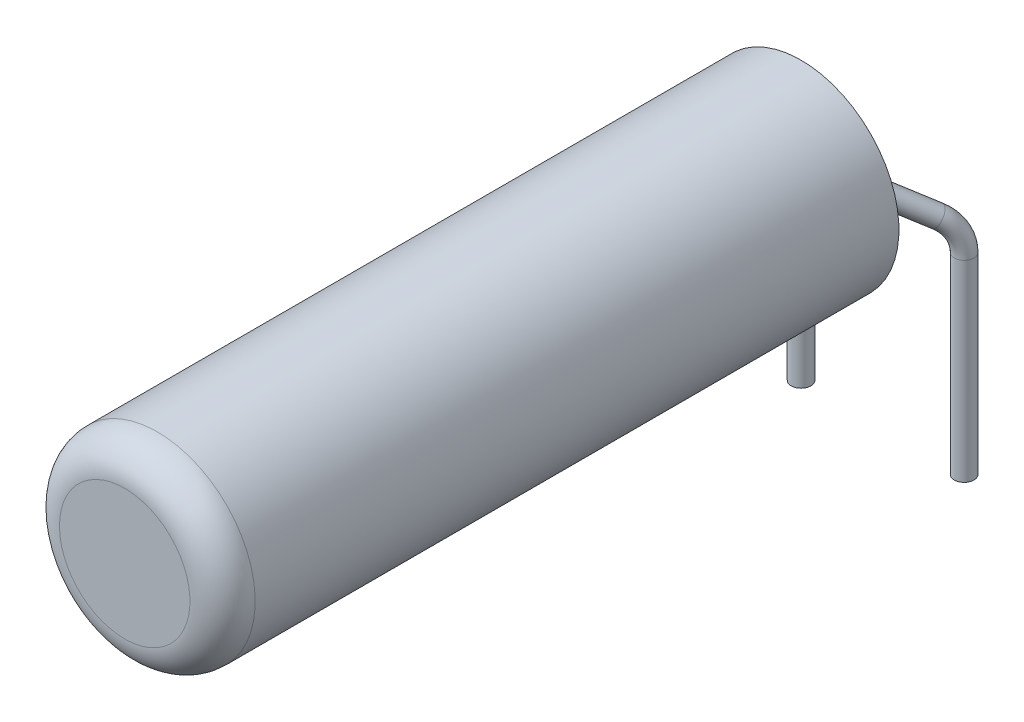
ISO-10303-21;
HEADER;
FILE_DESCRIPTION(('STEP AP214'),'2;1');
FILE_NAME('part.step','',(''),(''),'','','');
FILE_SCHEMA(('AUTOMOTIVE_DESIGN { 1 0 10303 214 1 1 1 1 }'));
ENDSEC;
DATA;
#1=APPLICATION_CONTEXT('core data for automotive mechanical design processes');
#2=APPLICATION_PROTOCOL_DEFINITION('international standard','automotive_design',2000,#1);
#3=PRODUCT_CONTEXT('',#1,'mechanical');
#4=PRODUCT('Part','Part','',(#3));
#5=PRODUCT_RELATED_PRODUCT_CATEGORY('part','',(#4));
#6=PRODUCT_DEFINITION_FORMATION('','',#4);
#7=PRODUCT_DEFINITION_CONTEXT('part definition',#1,'design');
#8=PRODUCT_DEFINITION('design','',#6,#7);
#9=PRODUCT_DEFINITION_SHAPE('','',#8);
#10=(LENGTH_UNIT() NAMED_UNIT(*) SI_UNIT(.MILLI.,.METRE.));
#11=(NAMED_UNIT(*) PLANE_ANGLE_UNIT() SI_UNIT($,.RADIAN.));
#12=(NAMED_UNIT(*) SI_UNIT($,.STERADIAN.) SOLID_ANGLE_UNIT());
#13=UNCERTAINTY_MEASURE_WITH_UNIT(LENGTH_MEASURE(1.E-05),#10,'distance_accuracy_value','');
#14=(GEOMETRIC_REPRESENTATION_CONTEXT(3) GLOBAL_UNCERTAINTY_ASSIGNED_CONTEXT((#13)) GLOBAL_UNIT_ASSIGNED_CONTEXT((#10,
#11,#12)) REPRESENTATION_CONTEXT('',''));
#15=CARTESIAN_POINT('',(0.,0.,0.));
#16=DIRECTION('',(0.,0.,1.));
#17=DIRECTION('',(1.,0.,0.));
#18=AXIS2_PLACEMENT_3D('',#15,#16,#17);
#19=CARTESIAN_POINT('',(0.,0.2,1.45));
#20=DIRECTION('',(0.,0.,1.));
#21=DIRECTION('',(1.,0.,0.));
#22=AXIS2_PLACEMENT_3D('',#19,#20,#21);
#23=PLANE('',#22);
#24=CARTESIAN_POINT('',(-0.55,1.5,1.45));
#25=DIRECTION('',(0.,0.,1.));
#26=DIRECTION('',(0.,1.,0.));
#27=AXIS2_PLACEMENT_3D('',#24,#25,#26);
#28=CIRCLE('',#27,0.15);
#29=CARTESIAN_POINT('',(-0.55,1.65,1.45));
#30=VERTEX_POINT('',#29);
#31=EDGE_CURVE('E108',#30,#30,#28,.T.);
#32=ORIENTED_EDGE('',*,*,#31,.T.);
#33=EDGE_LOOP('',(#32));
#34=FACE_BOUND('',#33,.T.);
#35=CARTESIAN_POINT('',(0.,1.5,1.45));
#36=DIRECTION('',(0.,0.,-1.));
#37=DIRECTION('',(-1.,0.,0.));
#38=AXIS2_PLACEMENT_3D('',#35,#36,#37);
#39=CIRCLE('',#38,1.3);
#40=CARTESIAN_POINT('',(-1.3,1.5,1.45));
#41=VERTEX_POINT('',#40);
#42=EDGE_CURVE('E57',#41,#41,#39,.T.);
#43=ORIENTED_EDGE('',*,*,#42,.T.);
#44=EDGE_LOOP('',(#43));
#45=FACE_BOUND('',#44,.T.);
#46=CARTESIAN_POINT('',(0.55,1.5,1.45));
#47=DIRECTION('',(0.,0.,-1.));
#48=DIRECTION('',(0.,1.,0.));
#49=AXIS2_PLACEMENT_3D('',#46,#47,#48);
#50=CIRCLE('',#49,0.15);
#51=CARTESIAN_POINT('',(0.55,1.65,1.45));
#52=VERTEX_POINT('',#51);
#53=EDGE_CURVE('E51',#52,#52,#50,.T.);
#54=ORIENTED_EDGE('',*,*,#53,.F.);
#55=EDGE_LOOP('',(#54));
#56=FACE_BOUND('',#55,.T.);
#57=ADVANCED_FACE('F36',(#34,#45,#56),#23,.F.);
#58=CARTESIAN_POINT('',(0.,0.,11.617328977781));
#59=DIRECTION('',(0.,0.,-1.));
#60=DIRECTION('',(-1.,0.,0.));
#61=AXIS2_PLACEMENT_3D('',#58,#59,#60);
#62=PLANE('',#61);
#63=CARTESIAN_POINT('',(0.,1.5,11.617328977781));
#64=DIRECTION('',(0.,0.,-1.));
#65=DIRECTION('',(-1.,0.,0.));
#66=AXIS2_PLACEMENT_3D('',#63,#64,#65);
#67=CIRCLE('',#66,1.);
#68=CARTESIAN_POINT('',(-1.,1.5,11.617328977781));
#69=VERTEX_POINT('',#68);
#70=EDGE_CURVE('E11',#69,#69,#67,.F.);
#71=ORIENTED_EDGE('',*,*,#70,.T.);
#72=EDGE_LOOP('',(#71));
#73=FACE_BOUND('',#72,.T.);
#74=ADVANCED_FACE('F38',(#73),#62,.F.);
#75=CARTESIAN_POINT('',(0.,1.5,1.45));
#76=DIRECTION('',(0.,0.,-1.));
#77=DIRECTION('',(-1.,0.,0.));
#78=AXIS2_PLACEMENT_3D('',#75,#76,#77);
#79=CYLINDRICAL_SURFACE('',#78,1.3);
#80=ORIENTED_EDGE('',*,*,#42,.F.);
#81=EDGE_LOOP('',(#80));
#82=FACE_BOUND('',#81,.T.);
#83=CARTESIAN_POINT('',(0.,1.5,1.25));
#84=DIRECTION('',(0.,0.,-1.));
#85=DIRECTION('',(-1.,0.,0.));
#86=AXIS2_PLACEMENT_3D('',#83,#84,#85);
#87=CIRCLE('',#86,1.3);
#88=CARTESIAN_POINT('',(-1.3,1.5,1.25));
#89=VERTEX_POINT('',#88);
#90=EDGE_CURVE('E63',#89,#89,#87,.T.);
#91=ORIENTED_EDGE('',*,*,#90,.T.);
#92=EDGE_LOOP('',(#91));
#93=FACE_BOUND('',#92,.T.);
#94=ADVANCED_FACE('F135',(#82,#93),#79,.F.);
#95=CARTESIAN_POINT('',(0.,0.,1.25));
#96=DIRECTION('',(0.,0.,1.));
#97=DIRECTION('',(1.,0.,0.));
#98=AXIS2_PLACEMENT_3D('',#95,#96,#97);
#99=PLANE('',#98);
#100=ORIENTED_EDGE('',*,*,#90,.F.);
#101=EDGE_LOOP('',(#100));
#102=FACE_BOUND('',#101,.T.);
#103=CARTESIAN_POINT('',(0.,1.5,1.25));
#104=DIRECTION('',(0.,0.,-1.));
#105=DIRECTION('',(-1.,0.,0.));
#106=AXIS2_PLACEMENT_3D('',#103,#104,#105);
#107=CIRCLE('',#106,1.5);
#108=CARTESIAN_POINT('',(-1.5,1.5,1.25));
#109=VERTEX_POINT('',#108);
#110=EDGE_CURVE('E66',#109,#109,#107,.T.);
#111=ORIENTED_EDGE('',*,*,#110,.T.);
#112=EDGE_LOOP('',(#111));
#113=FACE_BOUND('',#112,.T.);
#114=ADVANCED_FACE('F139',(#102,#113),#99,.F.);
#115=CARTESIAN_POINT('',(0.,1.5,1.45));
#116=DIRECTION('',(0.,0.,-1.));
#117=DIRECTION('',(-1.,0.,0.));
#118=AXIS2_PLACEMENT_3D('',#115,#116,#117);
#119=CYLINDRICAL_SURFACE('',#118,1.5);
#120=CARTESIAN_POINT('',(0.,1.5,11.117328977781));
#121=DIRECTION('',(0.,0.,-1.));
#122=DIRECTION('',(-1.,0.,0.));
#123=AXIS2_PLACEMENT_3D('',#120,#121,#122);
#124=CIRCLE('',#123,1.5);
#125=CARTESIAN_POINT('',(-1.5,1.5,11.117328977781));
#126=VERTEX_POINT('',#125);
#127=EDGE_CURVE('E44',#126,#126,#124,.T.);
#128=ORIENTED_EDGE('',*,*,#127,.T.);
#129=EDGE_LOOP('',(#128));
#130=FACE_BOUND('',#129,.T.);
#131=ORIENTED_EDGE('',*,*,#110,.F.);
#132=EDGE_LOOP('',(#131));
#133=FACE_BOUND('',#132,.T.);
#134=ADVANCED_FACE('F143',(#130,#133),#119,.T.);
#135=CARTESIAN_POINT('',(1.25,0.447647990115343,0.));
#136=DIRECTION('',(0.,-1.,0.));
#137=DIRECTION('',(1.,0.,0.));
#138=AXIS2_PLACEMENT_3D('',#135,#136,#137);
#139=CYLINDRICAL_SURFACE('',#138,0.15);
#140=CARTESIAN_POINT('',(1.25,0.447647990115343,0.));
#141=DIRECTION('',(0.,-1.,0.));
#142=DIRECTION('',(0.436891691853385,0.,-0.899514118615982));
#143=AXIS2_PLACEMENT_3D('',#140,#141,#142);
#144=CIRCLE('',#143,0.15);
#145=CARTESIAN_POINT('',(1.33897985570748,0.447647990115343,-0.120758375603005));
#146=VERTEX_POINT('',#145);
#147=EDGE_CURVE('E74',#146,#146,#144,.T.);
#148=ORIENTED_EDGE('',*,*,#147,.T.);
#149=EDGE_LOOP('',(#148));
#150=FACE_BOUND('',#149,.T.);
#151=CARTESIAN_POINT('',(1.25,-2.5,0.));
#152=DIRECTION('',(0.,-1.,0.));
#153=DIRECTION('',(0.436891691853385,0.,-0.899514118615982));
#154=AXIS2_PLACEMENT_3D('',#151,#152,#153);
#155=CIRCLE('',#154,0.15);
#156=CARTESIAN_POINT('',(1.31553375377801,-2.5,-0.134927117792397));
#157=VERTEX_POINT('',#156);
#158=EDGE_CURVE('E70',#157,#157,#155,.T.);
#159=ORIENTED_EDGE('',*,*,#158,.F.);
#160=EDGE_LOOP('',(#159));
#161=FACE_BOUND('',#160,.T.);
#162=ADVANCED_FACE('F147',(#150,#161),#139,.T.);
#163=CARTESIAN_POINT('',(0.89408057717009,0.447647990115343,0.483033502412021));
#164=DIRECTION('',(-0.805055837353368,0.,-0.59319903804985));
#165=DIRECTION('',(-0.59319903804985,0.,0.805055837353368));
#166=AXIS2_PLACEMENT_3D('',#163,#164,#165);
#167=TOROIDAL_SURFACE('',#166,0.6,0.15);
#168=CARTESIAN_POINT('',(1.07835898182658,0.960966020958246,0.232941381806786));
#169=DIRECTION('',(0.507499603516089,-0.517753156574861,-0.688749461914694));
#170=DIRECTION('',(0.155594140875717,0.841262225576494,-0.517753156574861));
#171=AXIS2_PLACEMENT_3D('',#168,#169,#170);
#172=CIRCLE('',#171,0.15);
#173=CARTESIAN_POINT('',(1.1244285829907,1.08929552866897,0.170418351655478));
#174=VERTEX_POINT('',#173);
#175=EDGE_CURVE('E78',#174,#174,#172,.T.);
#176=CARTESIAN_POINT('',(0.89408057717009,0.447647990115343,0.483033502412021));
#177=DIRECTION('',(-0.805055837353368,0.,-0.59319903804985));
#178=DIRECTION('',(-0.59319903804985,0.,0.805055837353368));
#179=AXIS2_PLACEMENT_3D('',#176,#177,#178);
#180=CIRCLE('',#179,0.75);
#181=EDGE_CURVE('',#174,#146,#180,.T.);
#182=ORIENTED_EDGE('',*,*,#175,.T.);
#183=ORIENTED_EDGE('',*,*,#147,.F.);
#184=ORIENTED_EDGE('',*,*,#181,.T.);
#185=ORIENTED_EDGE('',*,*,#181,.F.);
#186=EDGE_LOOP('',(#182,#184,#183,#185));
#187=FACE_BOUND('',#186,.T.);
#188=ADVANCED_FACE('F150',(#187),#167,.T.);
#189=CARTESIAN_POINT('',(0.680725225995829,1.3666335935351,0.772587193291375));
#190=DIRECTION('',(0.50749960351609,-0.517753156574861,-0.688749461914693));
#191=DIRECTION('',(0.,0.799336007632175,-0.600884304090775));
#192=AXIS2_PLACEMENT_3D('',#189,#190,#191);
#193=CYLINDRICAL_SURFACE('',#192,0.15);
#194=CARTESIAN_POINT('',(0.680725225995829,1.3666335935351,0.772587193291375));
#195=DIRECTION('',(0.507499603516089,-0.517753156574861,-0.688749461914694));
#196=DIRECTION('',(0.155594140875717,0.841262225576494,-0.517753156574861));
#197=AXIS2_PLACEMENT_3D('',#194,#195,#196);
#198=CIRCLE('',#197,0.15);
#199=CARTESIAN_POINT('',(0.608406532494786,1.44041341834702,0.663837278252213));
#200=VERTEX_POINT('',#199);
#201=EDGE_CURVE('E81',#200,#200,#198,.T.);
#202=ORIENTED_EDGE('',*,*,#201,.T.);
#203=EDGE_LOOP('',(#202));
#204=FACE_BOUND('',#203,.T.);
#205=ORIENTED_EDGE('',*,*,#175,.F.);
#206=EDGE_LOOP('',(#205));
#207=FACE_BOUND('',#206,.T.);
#208=ADVANCED_FACE('F154',(#204,#207),#193,.T.);
#209=CARTESIAN_POINT('',(0.97,1.07151429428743,1.20758685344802));
#210=DIRECTION('',(-0.714142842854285,-0.7,0.));
#211=DIRECTION('',(0.7,-0.714142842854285,0.));
#212=AXIS2_PLACEMENT_3D('',#209,#210,#211);
#213=TOROIDAL_SURFACE('',#212,0.6,0.15);
#214=CARTESIAN_POINT('',(0.55,1.5,1.20758685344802));
#215=DIRECTION('',(0.,0.,-1.));
#216=DIRECTION('',(0.,1.,0.));
#217=AXIS2_PLACEMENT_3D('',#214,#215,#216);
#218=CIRCLE('',#217,0.15);
#219=CARTESIAN_POINT('',(0.445,1.60712142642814,1.20758685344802));
#220=VERTEX_POINT('',#219);
#221=EDGE_CURVE('E85',#220,#220,#218,.T.);
#222=CARTESIAN_POINT('',(0.97,1.07151429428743,1.20758685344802));
#223=DIRECTION('',(-0.714142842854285,-0.7,0.));
#224=DIRECTION('',(0.7,-0.714142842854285,0.));
#225=AXIS2_PLACEMENT_3D('',#222,#223,#224);
#226=CIRCLE('',#225,0.75);
#227=EDGE_CURVE('',#220,#200,#226,.T.);
#228=ORIENTED_EDGE('',*,*,#221,.T.);
#229=ORIENTED_EDGE('',*,*,#201,.F.);
#230=ORIENTED_EDGE('',*,*,#227,.T.);
#231=ORIENTED_EDGE('',*,*,#227,.F.);
#232=EDGE_LOOP('',(#228,#230,#229,#231));
#233=FACE_BOUND('',#232,.T.);
#234=ADVANCED_FACE('F158',(#233),#213,.T.);
#235=CARTESIAN_POINT('',(0.55,1.5,1.20758685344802));
#236=DIRECTION('',(0.,0.,1.));
#237=DIRECTION('',(1.,0.,0.));
#238=AXIS2_PLACEMENT_3D('',#235,#236,#237);
#239=CYLINDRICAL_SURFACE('',#238,0.15);
#240=ORIENTED_EDGE('',*,*,#221,.F.);
#241=EDGE_LOOP('',(#240));
#242=FACE_BOUND('',#241,.T.);
#243=ORIENTED_EDGE('',*,*,#53,.T.);
#244=EDGE_LOOP('',(#243));
#245=FACE_BOUND('',#244,.T.);
#246=ADVANCED_FACE('F162',(#242,#245),#239,.T.);
#247=CARTESIAN_POINT('',(1.25,-2.5,0.));
#248=DIRECTION('',(0.,-1.,0.));
#249=DIRECTION('',(0.436891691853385,0.,-0.899514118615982));
#250=AXIS2_PLACEMENT_3D('',#247,#248,#249);
#251=PLANE('',#250);
#252=ORIENTED_EDGE('',*,*,#158,.T.);
#253=EDGE_LOOP('',(#252));
#254=FACE_BOUND('',#253,.T.);
#255=ADVANCED_FACE('F166',(#254),#251,.T.);
#256=CARTESIAN_POINT('',(-1.25,0.447647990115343,0.));
#257=DIRECTION('',(0.,-1.,0.));
#258=DIRECTION('',(1.,0.,0.));
#259=AXIS2_PLACEMENT_3D('',#256,#257,#258);
#260=CYLINDRICAL_SURFACE('',#259,0.15);
#261=CARTESIAN_POINT('',(-1.25,0.447647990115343,0.));
#262=DIRECTION('',(0.,1.,0.));
#263=DIRECTION('',(-0.436891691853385,0.,-0.899514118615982));
#264=AXIS2_PLACEMENT_3D('',#261,#262,#263);
#265=CIRCLE('',#264,0.15);
#266=CARTESIAN_POINT('',(-1.33897985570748,0.447647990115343,-0.120758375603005));
#267=VERTEX_POINT('',#266);
#268=EDGE_CURVE('E92',#267,#267,#265,.T.);
#269=ORIENTED_EDGE('',*,*,#268,.F.);
#270=EDGE_LOOP('',(#269));
#271=FACE_BOUND('',#270,.T.);
#272=CARTESIAN_POINT('',(-1.25,-2.5,0.));
#273=DIRECTION('',(0.,1.,0.));
#274=DIRECTION('',(-0.436891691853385,0.,-0.899514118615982));
#275=AXIS2_PLACEMENT_3D('',#272,#273,#274);
#276=CIRCLE('',#275,0.15);
#277=CARTESIAN_POINT('',(-1.31553375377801,-2.5,-0.134927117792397));
#278=VERTEX_POINT('',#277);
#279=EDGE_CURVE('E87',#278,#278,#276,.T.);
#280=ORIENTED_EDGE('',*,*,#279,.T.);
#281=EDGE_LOOP('',(#280));
#282=FACE_BOUND('',#281,.T.);
#283=ADVANCED_FACE('F170',(#271,#282),#260,.T.);
#284=CARTESIAN_POINT('',(-0.89408057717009,0.447647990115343,0.483033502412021));
#285=DIRECTION('',(-0.805055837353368,0.,0.59319903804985));
#286=DIRECTION('',(0.59319903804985,0.,0.805055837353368));
#287=AXIS2_PLACEMENT_3D('',#284,#285,#286);
#288=TOROIDAL_SURFACE('',#287,0.6,0.15);
#289=CARTESIAN_POINT('',(-1.07835898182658,0.960966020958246,0.232941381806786));
#290=DIRECTION('',(0.507499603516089,0.517753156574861,0.688749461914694));
#291=DIRECTION('',(-0.155594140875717,0.841262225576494,-0.517753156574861));
#292=AXIS2_PLACEMENT_3D('',#289,#290,#291);
#293=CIRCLE('',#292,0.15);
#294=CARTESIAN_POINT('',(-1.1244285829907,1.08929552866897,0.170418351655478));
#295=VERTEX_POINT('',#294);
#296=EDGE_CURVE('E96',#295,#295,#293,.T.);
#297=CARTESIAN_POINT('',(-0.89408057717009,0.447647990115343,0.483033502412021));
#298=DIRECTION('',(-0.805055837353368,0.,0.59319903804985));
#299=DIRECTION('',(0.59319903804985,0.,0.805055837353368));
#300=AXIS2_PLACEMENT_3D('',#297,#298,#299);
#301=CIRCLE('',#300,0.75);
#302=EDGE_CURVE('',#295,#267,#301,.T.);
#303=ORIENTED_EDGE('',*,*,#296,.F.);
#304=ORIENTED_EDGE('',*,*,#268,.T.);
#305=ORIENTED_EDGE('',*,*,#302,.T.);
#306=ORIENTED_EDGE('',*,*,#302,.F.);
#307=EDGE_LOOP('',(#303,#305,#304,#306));
#308=FACE_BOUND('',#307,.T.);
#309=ADVANCED_FACE('F174',(#308),#288,.T.);
#310=CARTESIAN_POINT('',(-0.680725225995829,1.3666335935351,0.772587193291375));
#311=DIRECTION('',(-0.50749960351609,-0.517753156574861,-0.688749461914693));
#312=DIRECTION('',(0.,0.799336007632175,-0.600884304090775));
#313=AXIS2_PLACEMENT_3D('',#310,#311,#312);
#314=CYLINDRICAL_SURFACE('',#313,0.15);
#315=CARTESIAN_POINT('',(-0.680725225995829,1.3666335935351,0.772587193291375));
#316=DIRECTION('',(0.507499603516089,0.517753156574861,0.688749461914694));
#317=DIRECTION('',(-0.155594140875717,0.841262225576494,-0.517753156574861));
#318=AXIS2_PLACEMENT_3D('',#315,#316,#317);
#319=CIRCLE('',#318,0.15);
#320=CARTESIAN_POINT('',(-0.608406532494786,1.44041341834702,0.663837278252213));
#321=VERTEX_POINT('',#320);
#322=EDGE_CURVE('E100',#321,#321,#319,.T.);
#323=ORIENTED_EDGE('',*,*,#322,.F.);
#324=EDGE_LOOP('',(#323));
#325=FACE_BOUND('',#324,.T.);
#326=ORIENTED_EDGE('',*,*,#296,.T.);
#327=EDGE_LOOP('',(#326));
#328=FACE_BOUND('',#327,.T.);
#329=ADVANCED_FACE('F128',(#325,#328),#314,.T.);
#330=CARTESIAN_POINT('',(-0.97,1.07151429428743,1.20758685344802));
#331=DIRECTION('',(-0.714142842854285,0.7,0.));
#332=DIRECTION('',(-0.7,-0.714142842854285,0.));
#333=AXIS2_PLACEMENT_3D('',#330,#331,#332);
#334=TOROIDAL_SURFACE('',#333,0.6,0.15);
#335=CARTESIAN_POINT('',(-0.55,1.5,1.20758685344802));
#336=DIRECTION('',(0.,0.,1.));
#337=DIRECTION('',(0.,1.,0.));
#338=AXIS2_PLACEMENT_3D('',#335,#336,#337);
#339=CIRCLE('',#338,0.15);
#340=CARTESIAN_POINT('',(-0.445,1.60712142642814,1.20758685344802));
#341=VERTEX_POINT('',#340);
#342=EDGE_CURVE('E104',#341,#341,#339,.T.);
#343=CARTESIAN_POINT('',(-0.97,1.07151429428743,1.20758685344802));
#344=DIRECTION('',(-0.714142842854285,0.7,0.));
#345=DIRECTION('',(-0.7,-0.714142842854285,0.));
#346=AXIS2_PLACEMENT_3D('',#343,#344,#345);
#347=CIRCLE('',#346,0.75);
#348=EDGE_CURVE('',#341,#321,#347,.T.);
#349=ORIENTED_EDGE('',*,*,#342,.F.);
#350=ORIENTED_EDGE('',*,*,#322,.T.);
#351=ORIENTED_EDGE('',*,*,#348,.T.);
#352=ORIENTED_EDGE('',*,*,#348,.F.);
#353=EDGE_LOOP('',(#349,#351,#350,#352));
#354=FACE_BOUND('',#353,.T.);
#355=ADVANCED_FACE('F118',(#354),#334,.T.);
#356=CARTESIAN_POINT('',(-0.55,1.5,1.20758685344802));
#357=DIRECTION('',(0.,0.,1.));
#358=DIRECTION('',(1.,0.,0.));
#359=AXIS2_PLACEMENT_3D('',#356,#357,#358);
#360=CYLINDRICAL_SURFACE('',#359,0.15);
#361=ORIENTED_EDGE('',*,*,#342,.T.);
#362=EDGE_LOOP('',(#361));
#363=FACE_BOUND('',#362,.T.);
#364=ORIENTED_EDGE('',*,*,#31,.F.);
#365=EDGE_LOOP('',(#364));
#366=FACE_BOUND('',#365,.T.);
#367=ADVANCED_FACE('F115',(#363,#366),#360,.T.);
#368=CARTESIAN_POINT('',(-1.25,-2.5,0.));
#369=DIRECTION('',(0.,-1.,0.));
#370=DIRECTION('',(-0.436891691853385,0.,-0.899514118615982));
#371=AXIS2_PLACEMENT_3D('',#368,#369,#370);
#372=PLANE('',#371);
#373=ORIENTED_EDGE('',*,*,#279,.F.);
#374=EDGE_LOOP('',(#373));
#375=FACE_BOUND('',#374,.T.);
#376=ADVANCED_FACE('F117',(#375),#372,.T.);
#377=CARTESIAN_POINT('',(0.,1.5,11.117328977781));
#378=DIRECTION('',(0.,0.,-1.));
#379=DIRECTION('',(-1.,0.,0.));
#380=AXIS2_PLACEMENT_3D('',#377,#378,#379);
#381=TOROIDAL_SURFACE('',#380,1.,0.5);
#382=ORIENTED_EDGE('',*,*,#70,.F.);
#383=EDGE_LOOP('',(#382));
#384=FACE_BOUND('',#383,.T.);
#385=ORIENTED_EDGE('',*,*,#127,.F.);
#386=EDGE_LOOP('',(#385));
#387=FACE_BOUND('',#386,.T.);
#388=ADVANCED_FACE('F125',(#384,#387),#381,.T.);
#389=CLOSED_SHELL('',(#57,#74,#94,#114,#134,#162,#188,#208,#234,#246,#255,#283,#309,#329,#355,
#367,#376,#388));
#390=MANIFOLD_SOLID_BREP('B2',#389);
#391=ADVANCED_BREP_SHAPE_REPRESENTATION('',(#18,#390),#14);
#392=SHAPE_DEFINITION_REPRESENTATION(#9,#391);
ENDSEC;
END-ISO-10303-21;
